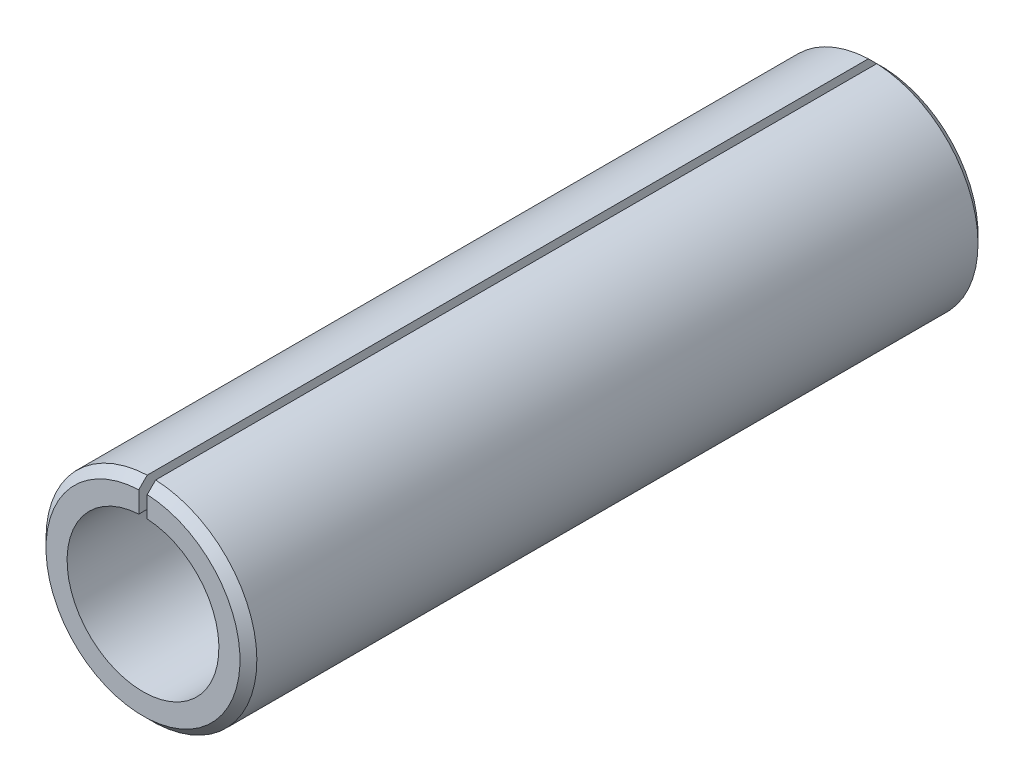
from build123d import *

# Parameters (mm, degrees)
BOSS_EXTRUDE1_DEPTH = 5.55625
CHAMFER1_SIZE       = 0.127


with BuildPart() as part:
    # Sketch1 → Boss-Extrude1 (new, symmetric)
    with BuildSketch(Plane.XY):
        with BuildLine():
            Line((-0.0635, 1.141234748), (-0.0635, 1.586229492))
            ThreePointArc((-0.0635, 1.586229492), (0, -1.5875), (0.0635, 1.586229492))
            Line((0.0635, 1.586229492), (0.0635, 1.141234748))
            ThreePointArc((0.0635, 1.141234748), (0, -1.143), (-0.0635, 1.141234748))
        make_face()
    extrude(amount=BOSS_EXTRUDE1_DEPTH, both=True)

    # Chamfer1
    chamfer1_edges = [part.edges().sort_by_distance(p)[0] for p in [
        (0, -1.5875, 5.55625),
        (0, -1.5875, -5.55625),
    ]]
    chamfer(chamfer1_edges, length=CHAMFER1_SIZE)


solid = part.part
